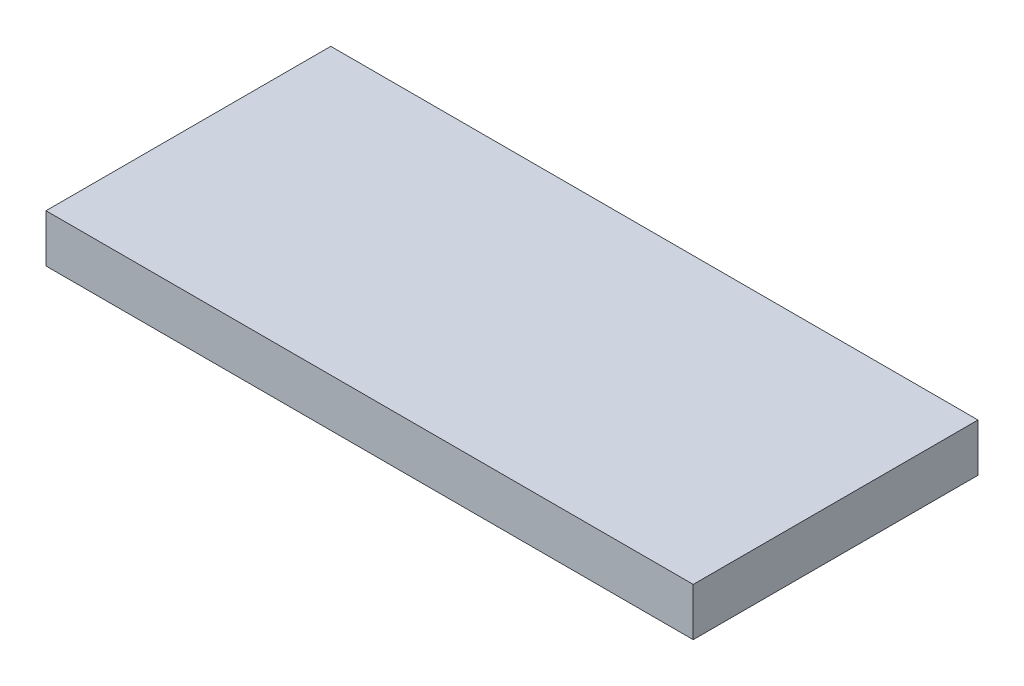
ISO-10303-21;
HEADER;
FILE_DESCRIPTION(('STEP AP214'),'2;1');
FILE_NAME('part.step','',(''),(''),'','','');
FILE_SCHEMA(('AUTOMOTIVE_DESIGN { 1 0 10303 214 1 1 1 1 }'));
ENDSEC;
DATA;
#1=APPLICATION_CONTEXT('core data for automotive mechanical design processes');
#2=APPLICATION_PROTOCOL_DEFINITION('international standard','automotive_design',2000,#1);
#3=PRODUCT_CONTEXT('',#1,'mechanical');
#4=PRODUCT('Part','Part','',(#3));
#5=PRODUCT_RELATED_PRODUCT_CATEGORY('part','',(#4));
#6=PRODUCT_DEFINITION_FORMATION('','',#4);
#7=PRODUCT_DEFINITION_CONTEXT('part definition',#1,'design');
#8=PRODUCT_DEFINITION('design','',#6,#7);
#9=PRODUCT_DEFINITION_SHAPE('','',#8);
#10=(LENGTH_UNIT() NAMED_UNIT(*) SI_UNIT(.MILLI.,.METRE.));
#11=(NAMED_UNIT(*) PLANE_ANGLE_UNIT() SI_UNIT($,.RADIAN.));
#12=(NAMED_UNIT(*) SI_UNIT($,.STERADIAN.) SOLID_ANGLE_UNIT());
#13=UNCERTAINTY_MEASURE_WITH_UNIT(LENGTH_MEASURE(1.E-05),#10,'distance_accuracy_value','');
#14=(GEOMETRIC_REPRESENTATION_CONTEXT(3) GLOBAL_UNCERTAINTY_ASSIGNED_CONTEXT((#13)) GLOBAL_UNIT_ASSIGNED_CONTEXT((#10,
#11,#12)) REPRESENTATION_CONTEXT('',''));
#15=CARTESIAN_POINT('',(0.,0.,0.));
#16=DIRECTION('',(0.,0.,1.));
#17=DIRECTION('',(1.,0.,0.));
#18=AXIS2_PLACEMENT_3D('',#15,#16,#17);
#19=CARTESIAN_POINT('',(6.35,-0.9398,2.794));
#20=DIRECTION('',(-1.,0.,0.));
#21=DIRECTION('',(0.,0.,1.));
#22=AXIS2_PLACEMENT_3D('',#19,#20,#21);
#23=PLANE('',#22);
#24=DIRECTION('',(0.,1.,0.));
#25=VECTOR('',#24,1.);
#26=CARTESIAN_POINT('',(6.35,-0.9398,-2.794));
#27=LINE('',#26,#25);
#28=CARTESIAN_POINT('',(6.35,-0.9398,-2.794));
#29=VERTEX_POINT('',#28);
#30=CARTESIAN_POINT('',(6.35,0.,-2.794));
#31=VERTEX_POINT('',#30);
#32=EDGE_CURVE('E99',#29,#31,#27,.T.);
#33=ORIENTED_EDGE('',*,*,#32,.T.);
#34=DIRECTION('',(0.,0.,-1.));
#35=VECTOR('',#34,1.);
#36=CARTESIAN_POINT('',(6.35,0.,2.794));
#37=LINE('',#36,#35);
#38=CARTESIAN_POINT('',(6.35,0.,2.794));
#39=VERTEX_POINT('',#38);
#40=EDGE_CURVE('E11',#39,#31,#37,.T.);
#41=ORIENTED_EDGE('',*,*,#40,.F.);
#42=DIRECTION('',(0.,1.,0.));
#43=VECTOR('',#42,1.);
#44=CARTESIAN_POINT('',(6.35,-0.9398,2.794));
#45=LINE('',#44,#43);
#46=CARTESIAN_POINT('',(6.35,-0.9398,2.794));
#47=VERTEX_POINT('',#46);
#48=EDGE_CURVE('E87',#47,#39,#45,.T.);
#49=ORIENTED_EDGE('',*,*,#48,.F.);
#50=DIRECTION('',(0.,0.,-1.));
#51=VECTOR('',#50,1.);
#52=CARTESIAN_POINT('',(6.35,-0.9398,2.794));
#53=LINE('',#52,#51);
#54=EDGE_CURVE('E95',#47,#29,#53,.T.);
#55=ORIENTED_EDGE('',*,*,#54,.T.);
#56=EDGE_LOOP('',(#33,#41,#49,#55));
#57=FACE_BOUND('',#56,.T.);
#58=ADVANCED_FACE('F36',(#57),#23,.F.);
#59=CARTESIAN_POINT('',(6.35,0.,2.794));
#60=DIRECTION('',(0.,-1.,0.));
#61=DIRECTION('',(1.,0.,0.));
#62=AXIS2_PLACEMENT_3D('',#59,#60,#61);
#63=PLANE('',#62);
#64=DIRECTION('',(-1.,0.,0.));
#65=VECTOR('',#64,1.);
#66=CARTESIAN_POINT('',(6.35,0.,-2.794));
#67=LINE('',#66,#65);
#68=CARTESIAN_POINT('',(-6.35,0.,-2.794));
#69=VERTEX_POINT('',#68);
#70=EDGE_CURVE('E91',#31,#69,#67,.T.);
#71=ORIENTED_EDGE('',*,*,#70,.T.);
#72=DIRECTION('',(0.,0.,-1.));
#73=VECTOR('',#72,1.);
#74=CARTESIAN_POINT('',(-6.35,0.,2.794));
#75=LINE('',#74,#73);
#76=CARTESIAN_POINT('',(-6.35,0.,2.794));
#77=VERTEX_POINT('',#76);
#78=EDGE_CURVE('E44',#77,#69,#75,.T.);
#79=ORIENTED_EDGE('',*,*,#78,.F.);
#80=DIRECTION('',(-1.,0.,0.));
#81=VECTOR('',#80,1.);
#82=CARTESIAN_POINT('',(6.35,0.,2.794));
#83=LINE('',#82,#81);
#84=EDGE_CURVE('E82',#39,#77,#83,.T.);
#85=ORIENTED_EDGE('',*,*,#84,.F.);
#86=ORIENTED_EDGE('',*,*,#40,.T.);
#87=EDGE_LOOP('',(#71,#79,#85,#86));
#88=FACE_BOUND('',#87,.T.);
#89=ADVANCED_FACE('F90',(#88),#63,.F.);
#90=CARTESIAN_POINT('',(-6.35,0.,2.794));
#91=DIRECTION('',(1.,0.,0.));
#92=DIRECTION('',(0.,0.,-1.));
#93=AXIS2_PLACEMENT_3D('',#90,#91,#92);
#94=PLANE('',#93);
#95=DIRECTION('',(0.,-1.,0.));
#96=VECTOR('',#95,1.);
#97=CARTESIAN_POINT('',(-6.35,0.,-2.794));
#98=LINE('',#97,#96);
#99=CARTESIAN_POINT('',(-6.35,-0.9398,-2.794));
#100=VERTEX_POINT('',#99);
#101=EDGE_CURVE('E69',#69,#100,#98,.T.);
#102=ORIENTED_EDGE('',*,*,#101,.T.);
#103=DIRECTION('',(0.,0.,-1.));
#104=VECTOR('',#103,1.);
#105=CARTESIAN_POINT('',(-6.35,-0.9398,2.794));
#106=LINE('',#105,#104);
#107=CARTESIAN_POINT('',(-6.35,-0.9398,2.794));
#108=VERTEX_POINT('',#107);
#109=EDGE_CURVE('E92',#108,#100,#106,.T.);
#110=ORIENTED_EDGE('',*,*,#109,.F.);
#111=DIRECTION('',(0.,-1.,0.));
#112=VECTOR('',#111,1.);
#113=CARTESIAN_POINT('',(-6.35,0.,2.794));
#114=LINE('',#113,#112);
#115=EDGE_CURVE('E85',#77,#108,#114,.T.);
#116=ORIENTED_EDGE('',*,*,#115,.F.);
#117=ORIENTED_EDGE('',*,*,#78,.T.);
#118=EDGE_LOOP('',(#102,#110,#116,#117));
#119=FACE_BOUND('',#118,.T.);
#120=ADVANCED_FACE('F93',(#119),#94,.F.);
#121=CARTESIAN_POINT('',(-6.35,-0.9398,2.794));
#122=DIRECTION('',(0.,1.,0.));
#123=DIRECTION('',(0.,0.,1.));
#124=AXIS2_PLACEMENT_3D('',#121,#122,#123);
#125=PLANE('',#124);
#126=DIRECTION('',(1.,0.,0.));
#127=VECTOR('',#126,1.);
#128=CARTESIAN_POINT('',(-6.35,-0.9398,-2.794));
#129=LINE('',#128,#127);
#130=EDGE_CURVE('E75',#100,#29,#129,.T.);
#131=ORIENTED_EDGE('',*,*,#130,.T.);
#132=ORIENTED_EDGE('',*,*,#54,.F.);
#133=DIRECTION('',(1.,0.,0.));
#134=VECTOR('',#133,1.);
#135=CARTESIAN_POINT('',(-6.35,-0.9398,2.794));
#136=LINE('',#135,#134);
#137=EDGE_CURVE('E52',#108,#47,#136,.T.);
#138=ORIENTED_EDGE('',*,*,#137,.F.);
#139=ORIENTED_EDGE('',*,*,#109,.T.);
#140=EDGE_LOOP('',(#131,#132,#138,#139));
#141=FACE_BOUND('',#140,.T.);
#142=ADVANCED_FACE('F106',(#141),#125,.F.);
#143=CARTESIAN_POINT('',(6.35,0.,2.794));
#144=DIRECTION('',(0.,0.,1.));
#145=DIRECTION('',(1.,0.,0.));
#146=AXIS2_PLACEMENT_3D('',#143,#144,#145);
#147=PLANE('',#146);
#148=ORIENTED_EDGE('',*,*,#48,.T.);
#149=ORIENTED_EDGE('',*,*,#84,.T.);
#150=ORIENTED_EDGE('',*,*,#115,.T.);
#151=ORIENTED_EDGE('',*,*,#137,.T.);
#152=EDGE_LOOP('',(#148,#149,#150,#151));
#153=FACE_BOUND('',#152,.T.);
#154=ADVANCED_FACE('F83',(#153),#147,.T.);
#155=CARTESIAN_POINT('',(6.35,0.,-2.794));
#156=DIRECTION('',(0.,0.,1.));
#157=DIRECTION('',(1.,0.,0.));
#158=AXIS2_PLACEMENT_3D('',#155,#156,#157);
#159=PLANE('',#158);
#160=ORIENTED_EDGE('',*,*,#32,.F.);
#161=ORIENTED_EDGE('',*,*,#130,.F.);
#162=ORIENTED_EDGE('',*,*,#101,.F.);
#163=ORIENTED_EDGE('',*,*,#70,.F.);
#164=EDGE_LOOP('',(#160,#161,#162,#163));
#165=FACE_BOUND('',#164,.T.);
#166=ADVANCED_FACE('F109',(#165),#159,.F.);
#167=CLOSED_SHELL('',(#58,#89,#120,#142,#154,#166));
#168=MANIFOLD_SOLID_BREP('B2',#167);
#169=ADVANCED_BREP_SHAPE_REPRESENTATION('',(#18,#168),#14);
#170=SHAPE_DEFINITION_REPRESENTATION(#9,#169);
ENDSEC;
END-ISO-10303-21;
